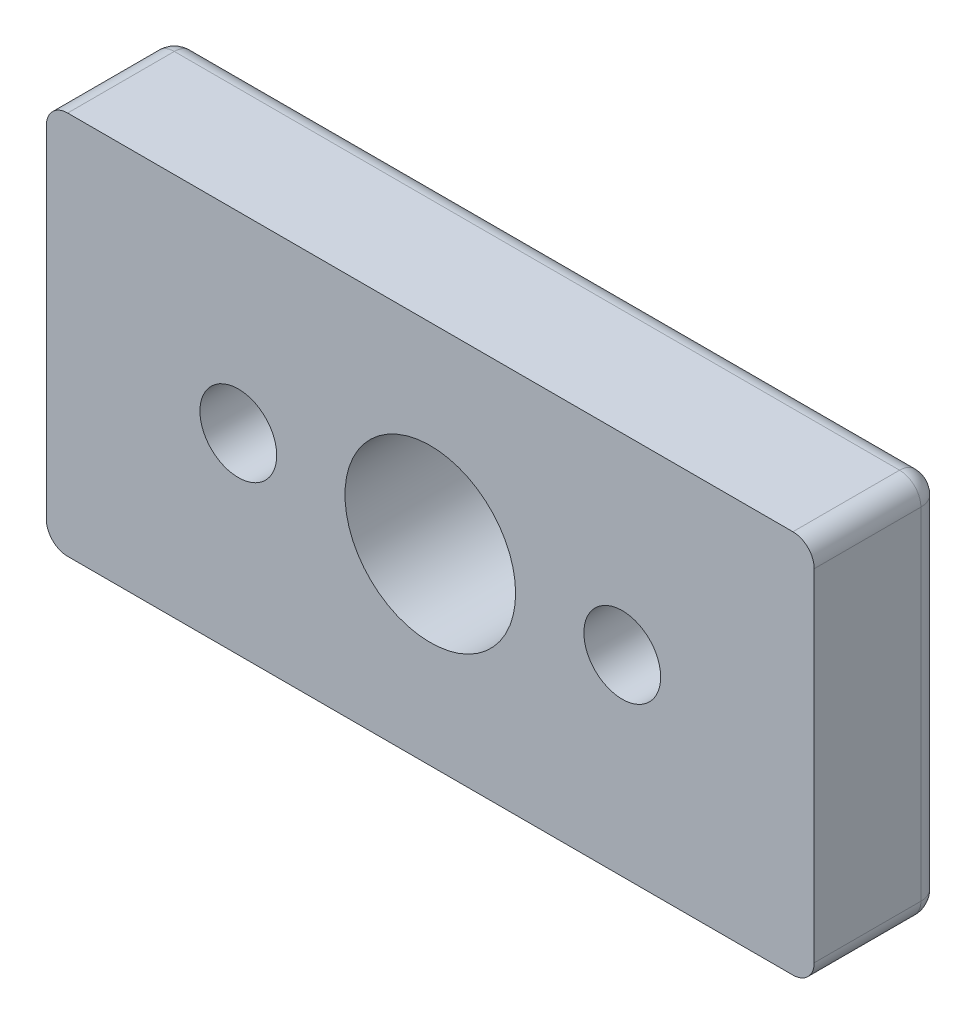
ISO-10303-21;
HEADER;
FILE_DESCRIPTION(('STEP AP214'),'2;1');
FILE_NAME('part.step','',(''),(''),'','','');
FILE_SCHEMA(('AUTOMOTIVE_DESIGN { 1 0 10303 214 1 1 1 1 }'));
ENDSEC;
DATA;
#1=APPLICATION_CONTEXT('core data for automotive mechanical design processes');
#2=APPLICATION_PROTOCOL_DEFINITION('international standard','automotive_design',2000,#1);
#3=PRODUCT_CONTEXT('',#1,'mechanical');
#4=PRODUCT('Part','Part','',(#3));
#5=PRODUCT_RELATED_PRODUCT_CATEGORY('part','',(#4));
#6=PRODUCT_DEFINITION_FORMATION('','',#4);
#7=PRODUCT_DEFINITION_CONTEXT('part definition',#1,'design');
#8=PRODUCT_DEFINITION('design','',#6,#7);
#9=PRODUCT_DEFINITION_SHAPE('','',#8);
#10=(LENGTH_UNIT() NAMED_UNIT(*) SI_UNIT(.MILLI.,.METRE.));
#11=(NAMED_UNIT(*) PLANE_ANGLE_UNIT() SI_UNIT($,.RADIAN.));
#12=(NAMED_UNIT(*) SI_UNIT($,.STERADIAN.) SOLID_ANGLE_UNIT());
#13=UNCERTAINTY_MEASURE_WITH_UNIT(LENGTH_MEASURE(1.E-05),#10,'distance_accuracy_value','');
#14=(GEOMETRIC_REPRESENTATION_CONTEXT(3) GLOBAL_UNCERTAINTY_ASSIGNED_CONTEXT((#13)) GLOBAL_UNIT_ASSIGNED_CONTEXT((#10,
#11,#12)) REPRESENTATION_CONTEXT('',''));
#15=CARTESIAN_POINT('',(0.,0.,0.));
#16=DIRECTION('',(0.,0.,1.));
#17=DIRECTION('',(1.,0.,0.));
#18=AXIS2_PLACEMENT_3D('',#15,#16,#17);
#19=CARTESIAN_POINT('',(22.5,0.,0.));
#20=DIRECTION('',(0.,0.,1.));
#21=DIRECTION('',(1.,0.,0.));
#22=AXIS2_PLACEMENT_3D('',#19,#20,#21);
#23=CYLINDRICAL_SURFACE('',#22,7.5);
#24=CARTESIAN_POINT('',(22.5,0.,5.5));
#25=DIRECTION('',(0.,0.,1.));
#26=DIRECTION('',(1.,0.,0.));
#27=AXIS2_PLACEMENT_3D('',#24,#25,#26);
#28=CIRCLE('',#27,7.5);
#29=CARTESIAN_POINT('',(30.,0.,5.5));
#30=VERTEX_POINT('',#29);
#31=EDGE_CURVE('E111',#30,#30,#28,.T.);
#32=ORIENTED_EDGE('',*,*,#31,.T.);
#33=EDGE_LOOP('',(#32));
#34=FACE_BOUND('',#33,.T.);
#35=CARTESIAN_POINT('',(22.5,0.,0.));
#36=DIRECTION('',(0.,0.,1.));
#37=DIRECTION('',(1.,0.,0.));
#38=AXIS2_PLACEMENT_3D('',#35,#36,#37);
#39=CIRCLE('',#38,7.5);
#40=CARTESIAN_POINT('',(30.,0.,0.));
#41=VERTEX_POINT('',#40);
#42=EDGE_CURVE('E113',#41,#41,#39,.F.);
#43=ORIENTED_EDGE('',*,*,#42,.T.);
#44=EDGE_LOOP('',(#43));
#45=FACE_BOUND('',#44,.T.);
#46=ADVANCED_FACE('F15',(#34,#45),#23,.F.);
#47=CARTESIAN_POINT('',(-22.5,0.,0.));
#48=DIRECTION('',(0.,0.,1.));
#49=DIRECTION('',(1.,0.,0.));
#50=AXIS2_PLACEMENT_3D('',#47,#48,#49);
#51=CYLINDRICAL_SURFACE('',#50,7.5);
#52=CARTESIAN_POINT('',(-22.5,0.,5.5));
#53=DIRECTION('',(0.,0.,1.));
#54=DIRECTION('',(1.,0.,0.));
#55=AXIS2_PLACEMENT_3D('',#52,#53,#54);
#56=CIRCLE('',#55,7.5);
#57=CARTESIAN_POINT('',(-15.,0.,5.5));
#58=VERTEX_POINT('',#57);
#59=EDGE_CURVE('E107',#58,#58,#56,.T.);
#60=ORIENTED_EDGE('',*,*,#59,.T.);
#61=EDGE_LOOP('',(#60));
#62=FACE_BOUND('',#61,.T.);
#63=CARTESIAN_POINT('',(-22.5,0.,0.));
#64=DIRECTION('',(0.,0.,1.));
#65=DIRECTION('',(1.,0.,0.));
#66=AXIS2_PLACEMENT_3D('',#63,#64,#65);
#67=CIRCLE('',#66,7.5);
#68=CARTESIAN_POINT('',(-15.,0.,0.));
#69=VERTEX_POINT('',#68);
#70=EDGE_CURVE('E19',#69,#69,#67,.F.);
#71=ORIENTED_EDGE('',*,*,#70,.T.);
#72=EDGE_LOOP('',(#71));
#73=FACE_BOUND('',#72,.T.);
#74=ADVANCED_FACE('F288',(#62,#73),#51,.F.);
#75=CARTESIAN_POINT('',(-21.25,20.,2.5));
#76=DIRECTION('',(-1.,0.,0.));
#77=DIRECTION('',(0.,0.,1.));
#78=AXIS2_PLACEMENT_3D('',#75,#76,#77);
#79=CYLINDRICAL_SURFACE('',#78,2.5);
#80=CARTESIAN_POINT('',(-42.5,20.,2.5));
#81=DIRECTION('',(1.,0.,0.));
#82=DIRECTION('',(0.,1.,0.));
#83=AXIS2_PLACEMENT_3D('',#80,#81,#82);
#84=CIRCLE('',#83,2.5);
#85=CARTESIAN_POINT('',(-42.5,22.5,2.5));
#86=VERTEX_POINT('',#85);
#87=CARTESIAN_POINT('',(-42.5,20.,0.));
#88=VERTEX_POINT('',#87);
#89=EDGE_CURVE('E235',#86,#88,#84,.F.);
#90=ORIENTED_EDGE('',*,*,#89,.F.);
#91=DIRECTION('',(1.,0.,0.));
#92=VECTOR('',#91,1.);
#93=CARTESIAN_POINT('',(-42.5,22.5,2.5));
#94=LINE('',#93,#92);
#95=CARTESIAN_POINT('',(42.5,22.5,2.5));
#96=VERTEX_POINT('',#95);
#97=EDGE_CURVE('E110',#96,#86,#94,.F.);
#98=ORIENTED_EDGE('',*,*,#97,.F.);
#99=CARTESIAN_POINT('',(42.5,20.,2.5));
#100=DIRECTION('',(1.,0.,0.));
#101=DIRECTION('',(0.,1.,0.));
#102=AXIS2_PLACEMENT_3D('',#99,#100,#101);
#103=CIRCLE('',#102,2.5);
#104=CARTESIAN_POINT('',(42.5,20.,0.));
#105=VERTEX_POINT('',#104);
#106=EDGE_CURVE('E249',#105,#96,#103,.T.);
#107=ORIENTED_EDGE('',*,*,#106,.F.);
#108=DIRECTION('',(1.,0.,0.));
#109=VECTOR('',#108,1.);
#110=CARTESIAN_POINT('',(0.,20.,0.));
#111=LINE('',#110,#109);
#112=EDGE_CURVE('E131',#105,#88,#111,.F.);
#113=ORIENTED_EDGE('',*,*,#112,.T.);
#114=EDGE_LOOP('',(#90,#98,#107,#113));
#115=FACE_BOUND('',#114,.T.);
#116=ADVANCED_FACE('F228',(#115),#79,.T.);
#117=CARTESIAN_POINT('',(-42.5,20.,2.5));
#118=DIRECTION('',(1.,0.,0.));
#119=DIRECTION('',(0.,1.,0.));
#120=AXIS2_PLACEMENT_3D('',#117,#118,#119);
#121=SPHERICAL_SURFACE('',#120,2.5);
#122=CARTESIAN_POINT('',(-42.5,20.,2.5));
#123=DIRECTION('',(0.,0.,1.));
#124=DIRECTION('',(1.,0.,0.));
#125=AXIS2_PLACEMENT_3D('',#122,#123,#124);
#126=CIRCLE('',#125,2.5);
#127=CARTESIAN_POINT('',(-45.,20.,2.5));
#128=VERTEX_POINT('',#127);
#129=EDGE_CURVE('E73',#86,#128,#126,.T.);
#130=ORIENTED_EDGE('',*,*,#129,.F.);
#131=ORIENTED_EDGE('',*,*,#89,.T.);
#132=CARTESIAN_POINT('',(-42.5,20.,2.5));
#133=DIRECTION('',(0.,-1.,0.));
#134=DIRECTION('',(0.,0.,-1.));
#135=AXIS2_PLACEMENT_3D('',#132,#133,#134);
#136=CIRCLE('',#135,2.5);
#137=EDGE_CURVE('E234',#128,#88,#136,.T.);
#138=ORIENTED_EDGE('',*,*,#137,.F.);
#139=EDGE_LOOP('',(#130,#131,#138));
#140=FACE_BOUND('',#139,.T.);
#141=ADVANCED_FACE('F223',(#140),#121,.T.);
#142=CARTESIAN_POINT('',(-42.5,-10.,2.5));
#143=DIRECTION('',(0.,-1.,0.));
#144=DIRECTION('',(0.,0.,-1.));
#145=AXIS2_PLACEMENT_3D('',#142,#143,#144);
#146=CYLINDRICAL_SURFACE('',#145,2.5);
#147=CARTESIAN_POINT('',(-42.5,-20.,2.5));
#148=DIRECTION('',(0.,1.,0.));
#149=DIRECTION('',(1.,0.,0.));
#150=AXIS2_PLACEMENT_3D('',#147,#148,#149);
#151=CIRCLE('',#150,2.5);
#152=CARTESIAN_POINT('',(-45.,-20.,2.5));
#153=VERTEX_POINT('',#152);
#154=CARTESIAN_POINT('',(-42.5,-20.,0.));
#155=VERTEX_POINT('',#154);
#156=EDGE_CURVE('E211',#153,#155,#151,.F.);
#157=ORIENTED_EDGE('',*,*,#156,.F.);
#158=DIRECTION('',(0.,1.,0.));
#159=VECTOR('',#158,1.);
#160=CARTESIAN_POINT('',(-45.,-20.,2.5));
#161=LINE('',#160,#159);
#162=EDGE_CURVE('E77',#128,#153,#161,.F.);
#163=ORIENTED_EDGE('',*,*,#162,.F.);
#164=ORIENTED_EDGE('',*,*,#137,.T.);
#165=DIRECTION('',(0.,1.,0.));
#166=VECTOR('',#165,1.);
#167=CARTESIAN_POINT('',(-42.5,0.,0.));
#168=LINE('',#167,#166);
#169=EDGE_CURVE('E122',#88,#155,#168,.F.);
#170=ORIENTED_EDGE('',*,*,#169,.T.);
#171=EDGE_LOOP('',(#157,#163,#164,#170));
#172=FACE_BOUND('',#171,.T.);
#173=ADVANCED_FACE('F219',(#172),#146,.T.);
#174=CARTESIAN_POINT('',(-42.5,-20.,2.5));
#175=DIRECTION('',(1.,0.,0.));
#176=DIRECTION('',(0.,1.,0.));
#177=AXIS2_PLACEMENT_3D('',#174,#175,#176);
#178=SPHERICAL_SURFACE('',#177,2.5);
#179=CARTESIAN_POINT('',(-42.5,-20.,2.5));
#180=DIRECTION('',(0.,0.,1.));
#181=DIRECTION('',(1.,0.,0.));
#182=AXIS2_PLACEMENT_3D('',#179,#180,#181);
#183=CIRCLE('',#182,2.50000000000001);
#184=CARTESIAN_POINT('',(-42.5,-22.5,2.5));
#185=VERTEX_POINT('',#184);
#186=EDGE_CURVE('E76',#153,#185,#183,.T.);
#187=ORIENTED_EDGE('',*,*,#186,.F.);
#188=ORIENTED_EDGE('',*,*,#156,.T.);
#189=CARTESIAN_POINT('',(-42.5,-20.,2.5));
#190=DIRECTION('',(1.,0.,0.));
#191=DIRECTION('',(0.,0.,-1.));
#192=AXIS2_PLACEMENT_3D('',#189,#190,#191);
#193=CIRCLE('',#192,2.5);
#194=EDGE_CURVE('E207',#185,#155,#193,.T.);
#195=ORIENTED_EDGE('',*,*,#194,.F.);
#196=EDGE_LOOP('',(#187,#188,#195));
#197=FACE_BOUND('',#196,.T.);
#198=ADVANCED_FACE('F216',(#197),#178,.T.);
#199=CARTESIAN_POINT('',(21.25,-20.,2.5));
#200=DIRECTION('',(1.,0.,0.));
#201=DIRECTION('',(0.,0.,-1.));
#202=AXIS2_PLACEMENT_3D('',#199,#200,#201);
#203=CYLINDRICAL_SURFACE('',#202,2.5);
#204=CARTESIAN_POINT('',(42.5,-20.,2.5));
#205=DIRECTION('',(1.,0.,0.));
#206=DIRECTION('',(0.,1.,0.));
#207=AXIS2_PLACEMENT_3D('',#204,#205,#206);
#208=CIRCLE('',#207,2.5);
#209=CARTESIAN_POINT('',(42.5,-22.5,2.50000000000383));
#210=VERTEX_POINT('',#209);
#211=CARTESIAN_POINT('',(42.5,-20.,0.));
#212=VERTEX_POINT('',#211);
#213=EDGE_CURVE('E203',#210,#212,#208,.T.);
#214=ORIENTED_EDGE('',*,*,#213,.F.);
#215=DIRECTION('',(1.,0.,0.));
#216=VECTOR('',#215,1.);
#217=CARTESIAN_POINT('',(42.5,-22.5,2.5));
#218=LINE('',#217,#216);
#219=EDGE_CURVE('E169',#185,#210,#218,.T.);
#220=ORIENTED_EDGE('',*,*,#219,.F.);
#221=ORIENTED_EDGE('',*,*,#194,.T.);
#222=DIRECTION('',(1.,0.,0.));
#223=VECTOR('',#222,1.);
#224=CARTESIAN_POINT('',(0.,-20.,0.));
#225=LINE('',#224,#223);
#226=EDGE_CURVE('E118',#155,#212,#225,.T.);
#227=ORIENTED_EDGE('',*,*,#226,.T.);
#228=EDGE_LOOP('',(#214,#220,#221,#227));
#229=FACE_BOUND('',#228,.T.);
#230=ADVANCED_FACE('F196',(#229),#203,.T.);
#231=CARTESIAN_POINT('',(42.5,-20.,2.5));
#232=DIRECTION('',(1.,0.,0.));
#233=DIRECTION('',(0.,1.,0.));
#234=AXIS2_PLACEMENT_3D('',#231,#232,#233);
#235=SPHERICAL_SURFACE('',#234,2.5);
#236=CARTESIAN_POINT('',(42.5,-20.,2.5));
#237=DIRECTION('',(0.,0.,1.));
#238=DIRECTION('',(1.,0.,0.));
#239=AXIS2_PLACEMENT_3D('',#236,#237,#238);
#240=CIRCLE('',#239,2.5);
#241=CARTESIAN_POINT('',(45.,-20.,2.5));
#242=VERTEX_POINT('',#241);
#243=EDGE_CURVE('E165',#210,#242,#240,.T.);
#244=ORIENTED_EDGE('',*,*,#243,.F.);
#245=ORIENTED_EDGE('',*,*,#213,.T.);
#246=CARTESIAN_POINT('',(42.5,-20.,2.5));
#247=DIRECTION('',(0.,1.,0.));
#248=DIRECTION('',(0.,0.,1.));
#249=AXIS2_PLACEMENT_3D('',#246,#247,#248);
#250=CIRCLE('',#249,2.5);
#251=EDGE_CURVE('E206',#242,#212,#250,.T.);
#252=ORIENTED_EDGE('',*,*,#251,.F.);
#253=EDGE_LOOP('',(#244,#245,#252));
#254=FACE_BOUND('',#253,.T.);
#255=ADVANCED_FACE('F191',(#254),#235,.T.);
#256=CARTESIAN_POINT('',(42.5,10.,2.5));
#257=DIRECTION('',(0.,1.,0.));
#258=DIRECTION('',(0.,0.,1.));
#259=AXIS2_PLACEMENT_3D('',#256,#257,#258);
#260=CYLINDRICAL_SURFACE('',#259,2.5);
#261=CARTESIAN_POINT('',(42.5,20.,2.5));
#262=DIRECTION('',(0.,1.,0.));
#263=DIRECTION('',(1.,0.,0.));
#264=AXIS2_PLACEMENT_3D('',#261,#262,#263);
#265=CIRCLE('',#264,2.5);
#266=CARTESIAN_POINT('',(45.,20.,2.5));
#267=VERTEX_POINT('',#266);
#268=EDGE_CURVE('E178',#267,#105,#265,.T.);
#269=ORIENTED_EDGE('',*,*,#268,.F.);
#270=DIRECTION('',(0.,1.,0.));
#271=VECTOR('',#270,1.);
#272=CARTESIAN_POINT('',(45.,20.,2.5));
#273=LINE('',#272,#271);
#274=EDGE_CURVE('E161',#242,#267,#273,.T.);
#275=ORIENTED_EDGE('',*,*,#274,.F.);
#276=ORIENTED_EDGE('',*,*,#251,.T.);
#277=DIRECTION('',(0.,1.,0.));
#278=VECTOR('',#277,1.);
#279=CARTESIAN_POINT('',(42.5,0.,0.));
#280=LINE('',#279,#278);
#281=EDGE_CURVE('E134',#212,#105,#280,.T.);
#282=ORIENTED_EDGE('',*,*,#281,.T.);
#283=EDGE_LOOP('',(#269,#275,#276,#282));
#284=FACE_BOUND('',#283,.T.);
#285=ADVANCED_FACE('F186',(#284),#260,.T.);
#286=CARTESIAN_POINT('',(42.5,20.,2.5));
#287=DIRECTION('',(1.,0.,0.));
#288=DIRECTION('',(0.,1.,0.));
#289=AXIS2_PLACEMENT_3D('',#286,#287,#288);
#290=SPHERICAL_SURFACE('',#289,2.5);
#291=CARTESIAN_POINT('',(42.5,20.,2.5));
#292=DIRECTION('',(0.,0.,1.));
#293=DIRECTION('',(1.,0.,0.));
#294=AXIS2_PLACEMENT_3D('',#291,#292,#293);
#295=CIRCLE('',#294,2.5);
#296=EDGE_CURVE('E156',#267,#96,#295,.T.);
#297=ORIENTED_EDGE('',*,*,#296,.F.);
#298=ORIENTED_EDGE('',*,*,#268,.T.);
#299=ORIENTED_EDGE('',*,*,#106,.T.);
#300=EDGE_LOOP('',(#297,#298,#299));
#301=FACE_BOUND('',#300,.T.);
#302=ADVANCED_FACE('F181',(#301),#290,.T.);
#303=CARTESIAN_POINT('',(0.,0.,0.));
#304=DIRECTION('',(0.,0.,1.));
#305=DIRECTION('',(1.,0.,0.));
#306=AXIS2_PLACEMENT_3D('',#303,#304,#305);
#307=PLANE('',#306);
#308=ORIENTED_EDGE('',*,*,#42,.F.);
#309=EDGE_LOOP('',(#308));
#310=FACE_BOUND('',#309,.T.);
#311=ORIENTED_EDGE('',*,*,#70,.F.);
#312=EDGE_LOOP('',(#311));
#313=FACE_BOUND('',#312,.T.);
#314=CARTESIAN_POINT('',(0.,0.,0.));
#315=DIRECTION('',(0.,0.,1.));
#316=DIRECTION('',(1.,0.,0.));
#317=AXIS2_PLACEMENT_3D('',#314,#315,#316);
#318=CIRCLE('',#317,10.);
#319=CARTESIAN_POINT('',(10.,0.,0.));
#320=VERTEX_POINT('',#319);
#321=EDGE_CURVE('E104',#320,#320,#318,.T.);
#322=ORIENTED_EDGE('',*,*,#321,.T.);
#323=EDGE_LOOP('',(#322));
#324=FACE_BOUND('',#323,.T.);
#325=ORIENTED_EDGE('',*,*,#169,.F.);
#326=ORIENTED_EDGE('',*,*,#112,.F.);
#327=ORIENTED_EDGE('',*,*,#281,.F.);
#328=ORIENTED_EDGE('',*,*,#226,.F.);
#329=EDGE_LOOP('',(#325,#326,#327,#328));
#330=FACE_BOUND('',#329,.T.);
#331=ADVANCED_FACE('F185',(#310,#313,#324,#330),#307,.F.);
#332=CARTESIAN_POINT('',(30.15,7.65,5.5));
#333=DIRECTION('',(0.,0.,1.));
#334=DIRECTION('',(-1.,0.,0.));
#335=AXIS2_PLACEMENT_3D('',#332,#333,#334);
#336=PLANE('',#335);
#337=CARTESIAN_POINT('',(22.5,0.,5.5));
#338=DIRECTION('',(0.,0.,1.));
#339=DIRECTION('',(1.,0.,0.));
#340=AXIS2_PLACEMENT_3D('',#337,#338,#339);
#341=CIRCLE('',#340,4.5);
#342=CARTESIAN_POINT('',(27.,0.,5.5));
#343=VERTEX_POINT('',#342);
#344=EDGE_CURVE('E101',#343,#343,#341,.T.);
#345=ORIENTED_EDGE('',*,*,#344,.T.);
#346=EDGE_LOOP('',(#345));
#347=FACE_BOUND('',#346,.T.);
#348=ORIENTED_EDGE('',*,*,#31,.F.);
#349=EDGE_LOOP('',(#348));
#350=FACE_BOUND('',#349,.T.);
#351=ADVANCED_FACE('F335',(#347,#350),#336,.F.);
#352=CARTESIAN_POINT('',(-14.85,7.65,5.5));
#353=DIRECTION('',(0.,0.,1.));
#354=DIRECTION('',(-1.,0.,0.));
#355=AXIS2_PLACEMENT_3D('',#352,#353,#354);
#356=PLANE('',#355);
#357=CARTESIAN_POINT('',(-22.5,0.,5.5));
#358=DIRECTION('',(0.,0.,1.));
#359=DIRECTION('',(1.,0.,0.));
#360=AXIS2_PLACEMENT_3D('',#357,#358,#359);
#361=CIRCLE('',#360,4.5);
#362=CARTESIAN_POINT('',(-18.,0.,5.5));
#363=VERTEX_POINT('',#362);
#364=EDGE_CURVE('E94',#363,#363,#361,.T.);
#365=ORIENTED_EDGE('',*,*,#364,.T.);
#366=EDGE_LOOP('',(#365));
#367=FACE_BOUND('',#366,.T.);
#368=ORIENTED_EDGE('',*,*,#59,.F.);
#369=EDGE_LOOP('',(#368));
#370=FACE_BOUND('',#369,.T.);
#371=ADVANCED_FACE('F17',(#367,#370),#356,.F.);
#372=CARTESIAN_POINT('',(-42.5,22.5,0.));
#373=DIRECTION('',(0.,1.,0.));
#374=DIRECTION('',(0.,0.,1.));
#375=AXIS2_PLACEMENT_3D('',#372,#373,#374);
#376=PLANE('',#375);
#377=DIRECTION('',(1.,0.,0.));
#378=VECTOR('',#377,1.);
#379=CARTESIAN_POINT('',(0.,22.5,15.));
#380=LINE('',#379,#378);
#381=CARTESIAN_POINT('',(42.5,22.5,15.));
#382=VERTEX_POINT('',#381);
#383=CARTESIAN_POINT('',(-42.5,22.5,15.));
#384=VERTEX_POINT('',#383);
#385=EDGE_CURVE('E92',#382,#384,#380,.F.);
#386=ORIENTED_EDGE('',*,*,#385,.F.);
#387=DIRECTION('',(0.,0.,1.));
#388=VECTOR('',#387,1.);
#389=CARTESIAN_POINT('',(42.5,22.5,0.));
#390=LINE('',#389,#388);
#391=EDGE_CURVE('E153',#96,#382,#390,.T.);
#392=ORIENTED_EDGE('',*,*,#391,.F.);
#393=ORIENTED_EDGE('',*,*,#97,.T.);
#394=DIRECTION('',(0.,0.,1.));
#395=VECTOR('',#394,1.);
#396=CARTESIAN_POINT('',(-42.5,22.5,0.));
#397=LINE('',#396,#395);
#398=EDGE_CURVE('E59',#384,#86,#397,.F.);
#399=ORIENTED_EDGE('',*,*,#398,.F.);
#400=EDGE_LOOP('',(#386,#392,#393,#399));
#401=FACE_BOUND('',#400,.T.);
#402=ADVANCED_FACE('F268',(#401),#376,.T.);
#403=CARTESIAN_POINT('',(-42.5,20.,0.));
#404=DIRECTION('',(0.,0.,1.));
#405=DIRECTION('',(1.,0.,0.));
#406=AXIS2_PLACEMENT_3D('',#403,#404,#405);
#407=CYLINDRICAL_SURFACE('',#406,2.5);
#408=CARTESIAN_POINT('',(-42.5,20.,15.));
#409=DIRECTION('',(0.,0.,1.));
#410=DIRECTION('',(1.,0.,0.));
#411=AXIS2_PLACEMENT_3D('',#408,#409,#410);
#412=CIRCLE('',#411,2.5);
#413=CARTESIAN_POINT('',(-45.,20.,15.));
#414=VERTEX_POINT('',#413);
#415=EDGE_CURVE('E69',#384,#414,#412,.T.);
#416=ORIENTED_EDGE('',*,*,#415,.F.);
#417=ORIENTED_EDGE('',*,*,#398,.T.);
#418=ORIENTED_EDGE('',*,*,#129,.T.);
#419=DIRECTION('',(0.,0.,1.));
#420=VECTOR('',#419,1.);
#421=CARTESIAN_POINT('',(-45.,20.,0.));
#422=LINE('',#421,#420);
#423=EDGE_CURVE('E65',#414,#128,#422,.F.);
#424=ORIENTED_EDGE('',*,*,#423,.F.);
#425=EDGE_LOOP('',(#416,#417,#418,#424));
#426=FACE_BOUND('',#425,.T.);
#427=ADVANCED_FACE('F67',(#426),#407,.T.);
#428=CARTESIAN_POINT('',(-45.,-20.,0.));
#429=DIRECTION('',(-1.,0.,0.));
#430=DIRECTION('',(0.,0.,1.));
#431=AXIS2_PLACEMENT_3D('',#428,#429,#430);
#432=PLANE('',#431);
#433=DIRECTION('',(0.,1.,0.));
#434=VECTOR('',#433,1.);
#435=CARTESIAN_POINT('',(-45.,0.,15.));
#436=LINE('',#435,#434);
#437=CARTESIAN_POINT('',(-45.,-20.,15.));
#438=VERTEX_POINT('',#437);
#439=EDGE_CURVE('E80',#414,#438,#436,.F.);
#440=ORIENTED_EDGE('',*,*,#439,.F.);
#441=ORIENTED_EDGE('',*,*,#423,.T.);
#442=ORIENTED_EDGE('',*,*,#162,.T.);
#443=DIRECTION('',(0.,0.,1.));
#444=VECTOR('',#443,1.);
#445=CARTESIAN_POINT('',(-45.,-20.,0.));
#446=LINE('',#445,#444);
#447=EDGE_CURVE('E83',#438,#153,#446,.F.);
#448=ORIENTED_EDGE('',*,*,#447,.F.);
#449=EDGE_LOOP('',(#440,#441,#442,#448));
#450=FACE_BOUND('',#449,.T.);
#451=ADVANCED_FACE('F81',(#450),#432,.T.);
#452=CARTESIAN_POINT('',(-42.5,-20.,0.));
#453=DIRECTION('',(0.,0.,1.));
#454=DIRECTION('',(1.,0.,0.));
#455=AXIS2_PLACEMENT_3D('',#452,#453,#454);
#456=CYLINDRICAL_SURFACE('',#455,2.50000000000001);
#457=CARTESIAN_POINT('',(-42.5,-20.,15.));
#458=DIRECTION('',(0.,0.,1.));
#459=DIRECTION('',(1.,0.,0.));
#460=AXIS2_PLACEMENT_3D('',#457,#458,#459);
#461=CIRCLE('',#460,2.50000000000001);
#462=CARTESIAN_POINT('',(-42.5,-22.5,15.));
#463=VERTEX_POINT('',#462);
#464=EDGE_CURVE('E87',#438,#463,#461,.T.);
#465=ORIENTED_EDGE('',*,*,#464,.F.);
#466=ORIENTED_EDGE('',*,*,#447,.T.);
#467=ORIENTED_EDGE('',*,*,#186,.T.);
#468=DIRECTION('',(0.,0.,-1.));
#469=VECTOR('',#468,1.);
#470=CARTESIAN_POINT('',(-42.5,-22.5,0.));
#471=LINE('',#470,#469);
#472=EDGE_CURVE('E166',#463,#185,#471,.T.);
#473=ORIENTED_EDGE('',*,*,#472,.F.);
#474=EDGE_LOOP('',(#465,#466,#467,#473));
#475=FACE_BOUND('',#474,.T.);
#476=ADVANCED_FACE('F323',(#475),#456,.T.);
#477=CARTESIAN_POINT('',(42.5,-22.5,0.));
#478=DIRECTION('',(0.,-1.,0.));
#479=DIRECTION('',(0.,0.,-1.));
#480=AXIS2_PLACEMENT_3D('',#477,#478,#479);
#481=PLANE('',#480);
#482=DIRECTION('',(1.,0.,0.));
#483=VECTOR('',#482,1.);
#484=CARTESIAN_POINT('',(0.,-22.5,15.));
#485=LINE('',#484,#483);
#486=CARTESIAN_POINT('',(42.5,-22.5,15.));
#487=VERTEX_POINT('',#486);
#488=EDGE_CURVE('E146',#463,#487,#485,.T.);
#489=ORIENTED_EDGE('',*,*,#488,.F.);
#490=ORIENTED_EDGE('',*,*,#472,.T.);
#491=ORIENTED_EDGE('',*,*,#219,.T.);
#492=DIRECTION('',(0.,0.,1.));
#493=VECTOR('',#492,1.);
#494=CARTESIAN_POINT('',(42.5,-22.5,0.));
#495=LINE('',#494,#493);
#496=EDGE_CURVE('E162',#487,#210,#495,.F.);
#497=ORIENTED_EDGE('',*,*,#496,.F.);
#498=EDGE_LOOP('',(#489,#490,#491,#497));
#499=FACE_BOUND('',#498,.T.);
#500=ADVANCED_FACE('F320',(#499),#481,.T.);
#501=CARTESIAN_POINT('',(42.5,-20.,0.));
#502=DIRECTION('',(0.,0.,1.));
#503=DIRECTION('',(1.,0.,0.));
#504=AXIS2_PLACEMENT_3D('',#501,#502,#503);
#505=CYLINDRICAL_SURFACE('',#504,2.5);
#506=CARTESIAN_POINT('',(42.5,-20.,15.));
#507=DIRECTION('',(0.,0.,1.));
#508=DIRECTION('',(1.,0.,0.));
#509=AXIS2_PLACEMENT_3D('',#506,#507,#508);
#510=CIRCLE('',#509,2.5);
#511=CARTESIAN_POINT('',(45.,-20.,15.));
#512=VERTEX_POINT('',#511);
#513=EDGE_CURVE('E144',#487,#512,#510,.T.);
#514=ORIENTED_EDGE('',*,*,#513,.F.);
#515=ORIENTED_EDGE('',*,*,#496,.T.);
#516=ORIENTED_EDGE('',*,*,#243,.T.);
#517=DIRECTION('',(0.,0.,-1.));
#518=VECTOR('',#517,1.);
#519=CARTESIAN_POINT('',(45.,-20.,0.));
#520=LINE('',#519,#518);
#521=EDGE_CURVE('E158',#512,#242,#520,.T.);
#522=ORIENTED_EDGE('',*,*,#521,.F.);
#523=EDGE_LOOP('',(#514,#515,#516,#522));
#524=FACE_BOUND('',#523,.T.);
#525=ADVANCED_FACE('F258',(#524),#505,.T.);
#526=CARTESIAN_POINT('',(45.,20.,0.));
#527=DIRECTION('',(1.,0.,0.));
#528=DIRECTION('',(0.,0.,-1.));
#529=AXIS2_PLACEMENT_3D('',#526,#527,#528);
#530=PLANE('',#529);
#531=DIRECTION('',(0.,1.,0.));
#532=VECTOR('',#531,1.);
#533=CARTESIAN_POINT('',(45.,0.,15.));
#534=LINE('',#533,#532);
#535=CARTESIAN_POINT('',(45.,20.,15.));
#536=VERTEX_POINT('',#535);
#537=EDGE_CURVE('E143',#512,#536,#534,.T.);
#538=ORIENTED_EDGE('',*,*,#537,.F.);
#539=ORIENTED_EDGE('',*,*,#521,.T.);
#540=ORIENTED_EDGE('',*,*,#274,.T.);
#541=DIRECTION('',(0.,0.,1.));
#542=VECTOR('',#541,1.);
#543=CARTESIAN_POINT('',(45.,20.,0.));
#544=LINE('',#543,#542);
#545=EDGE_CURVE('E34',#536,#267,#544,.F.);
#546=ORIENTED_EDGE('',*,*,#545,.F.);
#547=EDGE_LOOP('',(#538,#539,#540,#546));
#548=FACE_BOUND('',#547,.T.);
#549=ADVANCED_FACE('F264',(#548),#530,.T.);
#550=CARTESIAN_POINT('',(42.5,20.,0.));
#551=DIRECTION('',(0.,0.,1.));
#552=DIRECTION('',(1.,0.,0.));
#553=AXIS2_PLACEMENT_3D('',#550,#551,#552);
#554=CYLINDRICAL_SURFACE('',#553,2.5);
#555=CARTESIAN_POINT('',(42.5,20.,15.));
#556=DIRECTION('',(0.,0.,1.));
#557=DIRECTION('',(1.,0.,0.));
#558=AXIS2_PLACEMENT_3D('',#555,#556,#557);
#559=CIRCLE('',#558,2.5);
#560=EDGE_CURVE('E142',#536,#382,#559,.T.);
#561=ORIENTED_EDGE('',*,*,#560,.F.);
#562=ORIENTED_EDGE('',*,*,#545,.T.);
#563=ORIENTED_EDGE('',*,*,#296,.T.);
#564=ORIENTED_EDGE('',*,*,#391,.T.);
#565=EDGE_LOOP('',(#561,#562,#563,#564));
#566=FACE_BOUND('',#565,.T.);
#567=ADVANCED_FACE('F267',(#566),#554,.T.);
#568=CARTESIAN_POINT('',(0.,0.,0.));
#569=DIRECTION('',(0.,0.,1.));
#570=DIRECTION('',(1.,0.,0.));
#571=AXIS2_PLACEMENT_3D('',#568,#569,#570);
#572=CYLINDRICAL_SURFACE('',#571,10.);
#573=ORIENTED_EDGE('',*,*,#321,.F.);
#574=EDGE_LOOP('',(#573));
#575=FACE_BOUND('',#574,.T.);
#576=CARTESIAN_POINT('',(0.,0.,15.));
#577=DIRECTION('',(0.,0.,1.));
#578=DIRECTION('',(1.,0.,0.));
#579=AXIS2_PLACEMENT_3D('',#576,#577,#578);
#580=CIRCLE('',#579,10.);
#581=CARTESIAN_POINT('',(10.,0.,15.));
#582=VERTEX_POINT('',#581);
#583=EDGE_CURVE('E139',#582,#582,#580,.F.);
#584=ORIENTED_EDGE('',*,*,#583,.F.);
#585=EDGE_LOOP('',(#584));
#586=FACE_BOUND('',#585,.T.);
#587=ADVANCED_FACE('F309',(#575,#586),#572,.F.);
#588=CARTESIAN_POINT('',(22.5,0.,0.));
#589=DIRECTION('',(0.,0.,1.));
#590=DIRECTION('',(1.,0.,0.));
#591=AXIS2_PLACEMENT_3D('',#588,#589,#590);
#592=CYLINDRICAL_SURFACE('',#591,4.5);
#593=CARTESIAN_POINT('',(22.5,0.,15.));
#594=DIRECTION('',(0.,0.,1.));
#595=DIRECTION('',(1.,0.,0.));
#596=AXIS2_PLACEMENT_3D('',#593,#594,#595);
#597=CIRCLE('',#596,4.5);
#598=CARTESIAN_POINT('',(27.,0.,15.));
#599=VERTEX_POINT('',#598);
#600=EDGE_CURVE('E25',#599,#599,#597,.F.);
#601=ORIENTED_EDGE('',*,*,#600,.F.);
#602=EDGE_LOOP('',(#601));
#603=FACE_BOUND('',#602,.T.);
#604=ORIENTED_EDGE('',*,*,#344,.F.);
#605=EDGE_LOOP('',(#604));
#606=FACE_BOUND('',#605,.T.);
#607=ADVANCED_FACE('F302',(#603,#606),#592,.F.);
#608=CARTESIAN_POINT('',(-22.5,0.,0.));
#609=DIRECTION('',(0.,0.,1.));
#610=DIRECTION('',(1.,0.,0.));
#611=AXIS2_PLACEMENT_3D('',#608,#609,#610);
#612=CYLINDRICAL_SURFACE('',#611,4.5);
#613=CARTESIAN_POINT('',(-22.5,0.,15.));
#614=DIRECTION('',(0.,0.,1.));
#615=DIRECTION('',(1.,0.,0.));
#616=AXIS2_PLACEMENT_3D('',#613,#614,#615);
#617=CIRCLE('',#616,4.5);
#618=CARTESIAN_POINT('',(-18.,0.,15.));
#619=VERTEX_POINT('',#618);
#620=EDGE_CURVE('E10',#619,#619,#617,.F.);
#621=ORIENTED_EDGE('',*,*,#620,.F.);
#622=EDGE_LOOP('',(#621));
#623=FACE_BOUND('',#622,.T.);
#624=ORIENTED_EDGE('',*,*,#364,.F.);
#625=EDGE_LOOP('',(#624));
#626=FACE_BOUND('',#625,.T.);
#627=ADVANCED_FACE('F296',(#623,#626),#612,.F.);
#628=CARTESIAN_POINT('',(0.,0.,15.));
#629=DIRECTION('',(0.,0.,1.));
#630=DIRECTION('',(1.,0.,0.));
#631=AXIS2_PLACEMENT_3D('',#628,#629,#630);
#632=PLANE('',#631);
#633=ORIENTED_EDGE('',*,*,#620,.T.);
#634=EDGE_LOOP('',(#633));
#635=FACE_BOUND('',#634,.T.);
#636=ORIENTED_EDGE('',*,*,#600,.T.);
#637=EDGE_LOOP('',(#636));
#638=FACE_BOUND('',#637,.T.);
#639=ORIENTED_EDGE('',*,*,#583,.T.);
#640=EDGE_LOOP('',(#639));
#641=FACE_BOUND('',#640,.T.);
#642=ORIENTED_EDGE('',*,*,#537,.T.);
#643=ORIENTED_EDGE('',*,*,#560,.T.);
#644=ORIENTED_EDGE('',*,*,#385,.T.);
#645=ORIENTED_EDGE('',*,*,#415,.T.);
#646=ORIENTED_EDGE('',*,*,#439,.T.);
#647=ORIENTED_EDGE('',*,*,#464,.T.);
#648=ORIENTED_EDGE('',*,*,#488,.T.);
#649=ORIENTED_EDGE('',*,*,#513,.T.);
#650=EDGE_LOOP('',(#642,#643,#644,#645,#646,#647,#648,#649));
#651=FACE_BOUND('',#650,.T.);
#652=ADVANCED_FACE('F90',(#635,#638,#641,#651),#632,.T.);
#653=CLOSED_SHELL('',(#46,#74,#116,#141,#173,#198,#230,#255,#285,#302,#331,#351,#371,#402,#427,
#451,#476,#500,#525,#549,#567,#587,#607,#627,#652));
#654=MANIFOLD_SOLID_BREP('B1',#653);
#655=ADVANCED_BREP_SHAPE_REPRESENTATION('',(#18,#654),#14);
#656=SHAPE_DEFINITION_REPRESENTATION(#9,#655);
ENDSEC;
END-ISO-10303-21;
